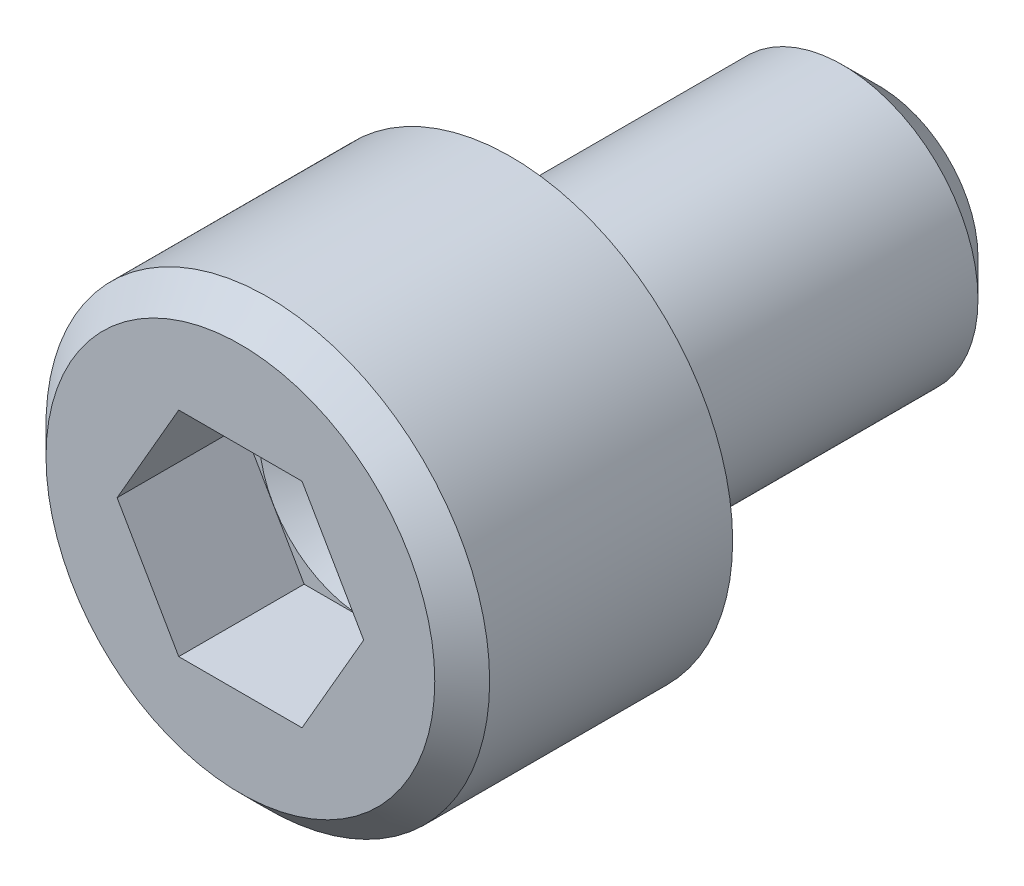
from build123d import *

# Parameters (mm, degrees)
FILLET1_R          = 0.254
CUT_EXTRUDE1_DEPTH = 1.6256


with BuildPart() as part:
    # Sketch1 → Revolve1 (revolve)
    with BuildSketch(Plane(origin=(0, 0, 0), x_dir=(0, 0, -1), z_dir=(1, 0, 0)), mode=Mode.PRIVATE) as revolve1_sk:
        Polygon((0, 0), (8.2804, 0), (8.2804, 1.28016), (7.80796, 1.7526), (3.5052, 1.7526), (3.5052, 2.8752), (0.3556, 2.8752), (0, 2.5196), align=None)
    revolve(revolve1_sk.sketch.rotate(Axis((0, 0, 0), (0, 0, -1)), 90), axis=Axis((0, 0, 0), (0, 0, -1)))

    # Fillet1
    fillet1_edges = [part.edges().sort_by_distance(p)[0] for p in [
        (-1.7526, 0, -3.5052),
    ]]
    fillet(fillet1_edges, radius=FILLET1_R)

    # Sketch2 → Cut-Revolve1 (revolve, cut)
    with BuildSketch(Plane(origin=(0, 0, 0), x_dir=(0, 0, -1), z_dir=(1, 0, 0)), mode=Mode.PRIVATE) as cut_revolve1_sk:
        Polygon((2.424252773, 0), (1.6252, 1.384), (0, 1.384), (0, 0), align=None)
    revolve(cut_revolve1_sk.sketch.rotate(Axis((0, 0, 0), (0, 0, -1)), 180), axis=Axis((0, 0, 0), (0, 0, -1)), mode=Mode.SUBTRACT)

    # Sketch3 → Cut-Extrude1 (cut)
    with BuildSketch(Plane.XY):
        Polygon((0.799052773, 1.384), (-0.799052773, 1.384), (-1.598105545, 0), (-0.799052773, -1.384), (0.799052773, -1.384), (1.598105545, 0), align=None)
    extrude(amount=-CUT_EXTRUDE1_DEPTH, mode=Mode.SUBTRACT)


solid = part.part
